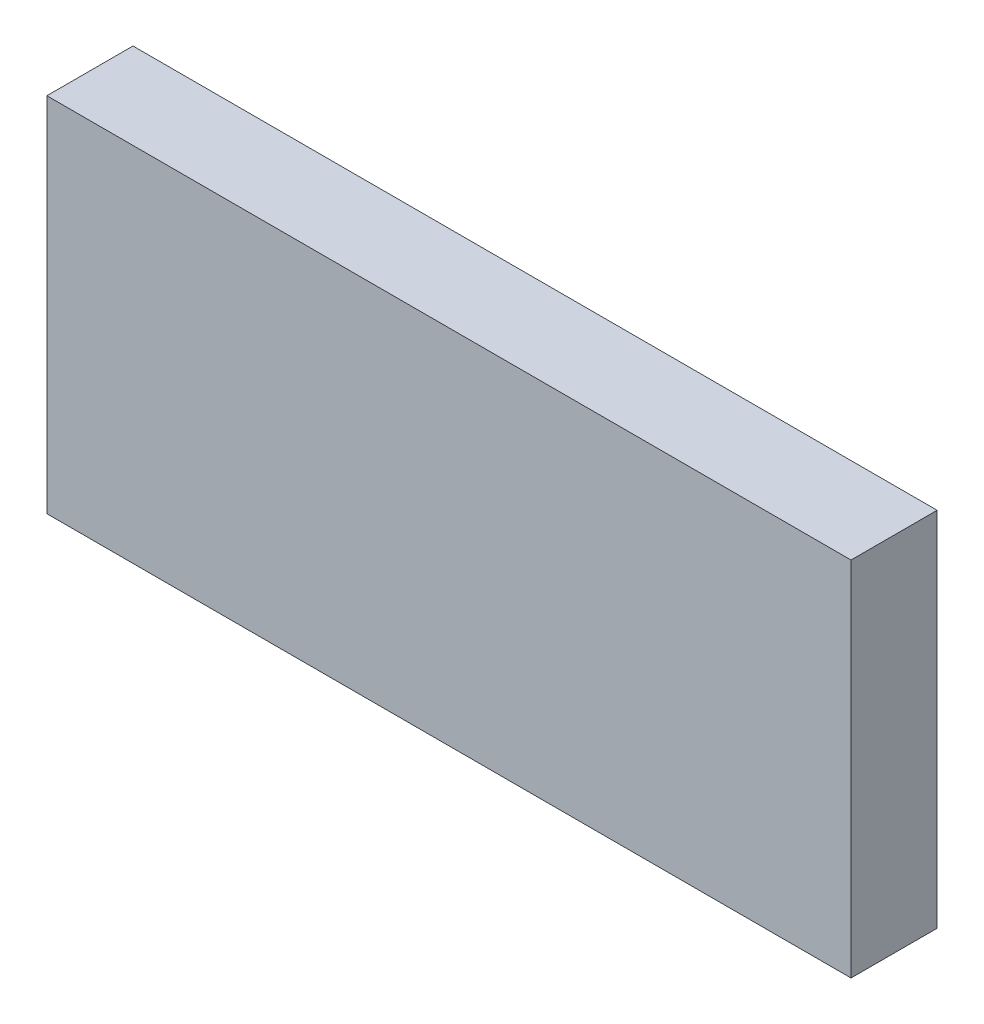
from build123d import *

# Parameters (mm, degrees)
SKETCH2_W      = 104.359369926
SKETCH2_H      = 46.977113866
EXTRUDE1_DEPTH = 11.176


with BuildPart() as part:
    # Sketch2 → Extrude1 (new body)
    with BuildSketch(Plane.XY):
        Rectangle(SKETCH2_W, SKETCH2_H)
    extrude(amount=EXTRUDE1_DEPTH)


solid = part.part
